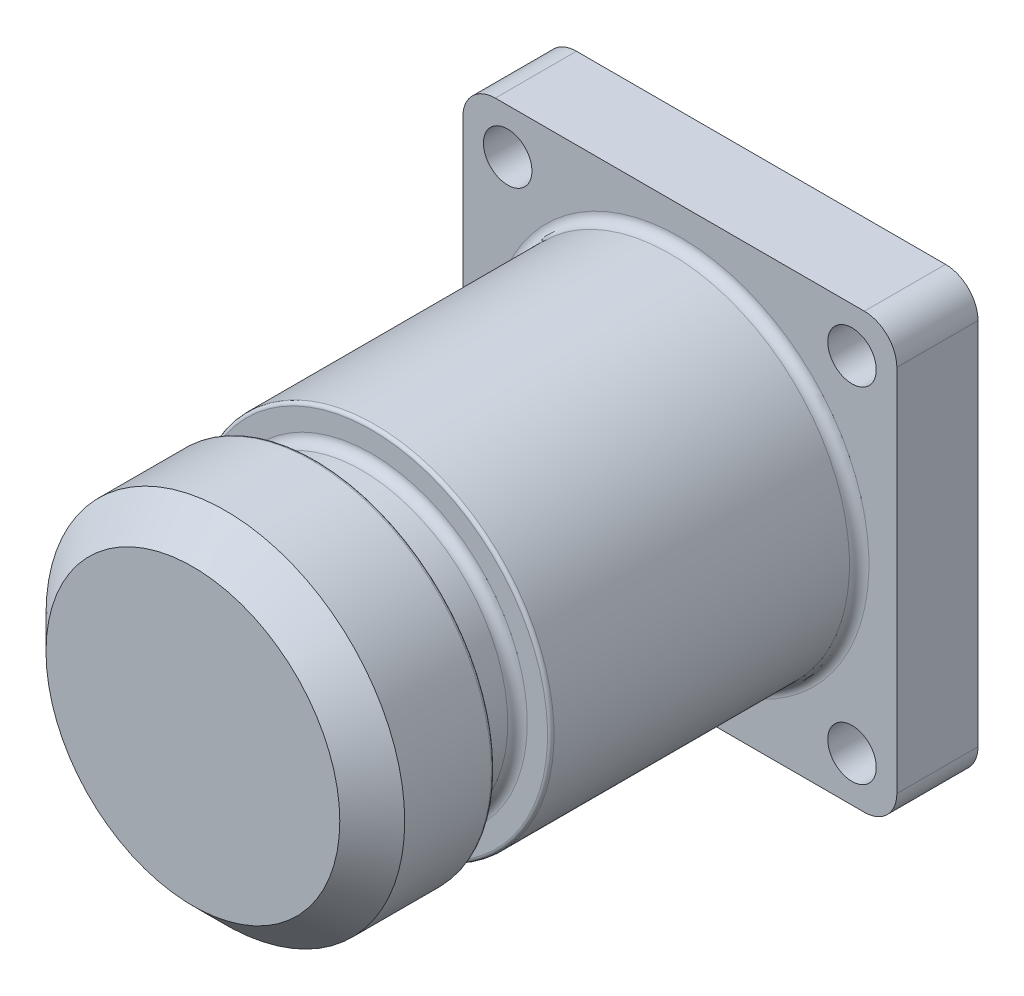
from build123d import *

# Parameters (mm, degrees)
BOSS_EXTRUDE1_START   = -6.35
SKETCH3_W             = 33.957006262
SKETCH3_H             = 33.957006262
SKETCH3_R             = 14.0335
BOSS_EXTRUDE1_DEPTH   = 6.35
F_6_CLEARANCE_HOLE1_D = 3.7973
FILLET1_R             = 2.54
CHAMFER1_SIZE         = 2.54
O_RING_RADIUS_R       = 0.762
O_RING_BREAK_EDGE_R   = 0.254
FILLET_MAX_R          = 0.762


with BuildPart() as part:
    # Sketch2 → plug_o-ring_2-118 (revolve)
    with BuildSketch(Plane(origin=(0, 0, 0), x_dir=(0, 0, -1), z_dir=(1, 0, 0)), mode=Mode.PRIVATE) as plug_o_ring_2_118_sk:
        Polygon((0, 14.0335), (0, 16.978503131), (6.35, 16.978503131), (6.35, 0), (-38.1, 0), (-38.1, 14.0335), (-28.5242, 14.0335), (-28.5242, 11.43), (-24.13, 11.43), (-24.13, 14.0335), align=None)
    revolve(plug_o_ring_2_118_sk.sketch.rotate(Axis((0, 0, 0.145825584), (0, 0, -1)), 90), axis=Axis((0, 0, 0.145825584), (0, 0, -1)))

    # Sketch3 → Boss-Extrude1 (add)
    with BuildSketch(Plane.XY.offset(BOSS_EXTRUDE1_START)):
        Rectangle(SKETCH3_W, SKETCH3_H)
        Circle(SKETCH3_R, mode=Mode.SUBTRACT)
    extrude(amount=BOSS_EXTRUDE1_DEPTH)

    # 6 Clearance Hole1 (through all)
    with Locations(Plane(origin=(0, 0, -6.35), x_dir=(-1, 0, 0), z_dir=(0, 0, -1))):
        with Locations((-13.470384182, 13.470384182), (13.470384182, 13.470384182), (13.470384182, -13.470384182), (-13.470384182, -13.470384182)):
            Hole(F_6_CLEARANCE_HOLE1_D / 2)

    # Fillet1
    fillet1_edges = [part.edges().sort_by_distance(p)[0] for p in [
        (-16.978503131, -16.978503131, -3.175),
        (-16.978503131, 16.978503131, -3.175),
        (16.978503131, 16.978503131, -3.175),
        (16.978503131, -16.978503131, -3.175),
    ]]
    fillet(fillet1_edges, radius=FILLET1_R)

    # Chamfer1
    chamfer1_edges = [part.edges().sort_by_distance(p)[0] for p in [
        (-14.0335, 0, 38.1),
    ]]
    chamfer(chamfer1_edges, length=CHAMFER1_SIZE)

    # o-ring_radius
    o_ring_radius_edges = [part.edges().sort_by_distance(p)[0] for p in [
        (-11.43, 0, 28.5242),
        (-11.43, 0, 24.13),
    ]]
    fillet(o_ring_radius_edges, radius=O_RING_RADIUS_R)

    # o-ring_break_edge
    o_ring_break_edge_edges = [part.edges().sort_by_distance(p)[0] for p in [
        (-14.0335, 0, 28.5242),
        (-14.0335, 0, 24.13),
    ]]
    fillet(o_ring_break_edge_edges, radius=O_RING_BREAK_EDGE_R)

    # fillet_max
    fillet_max_edges = [part.edges().sort_by_distance(p)[0] for p in [
        (-14.0335, 0, 0),
    ]]
    fillet(fillet_max_edges, radius=FILLET_MAX_R)


solid = part.part
